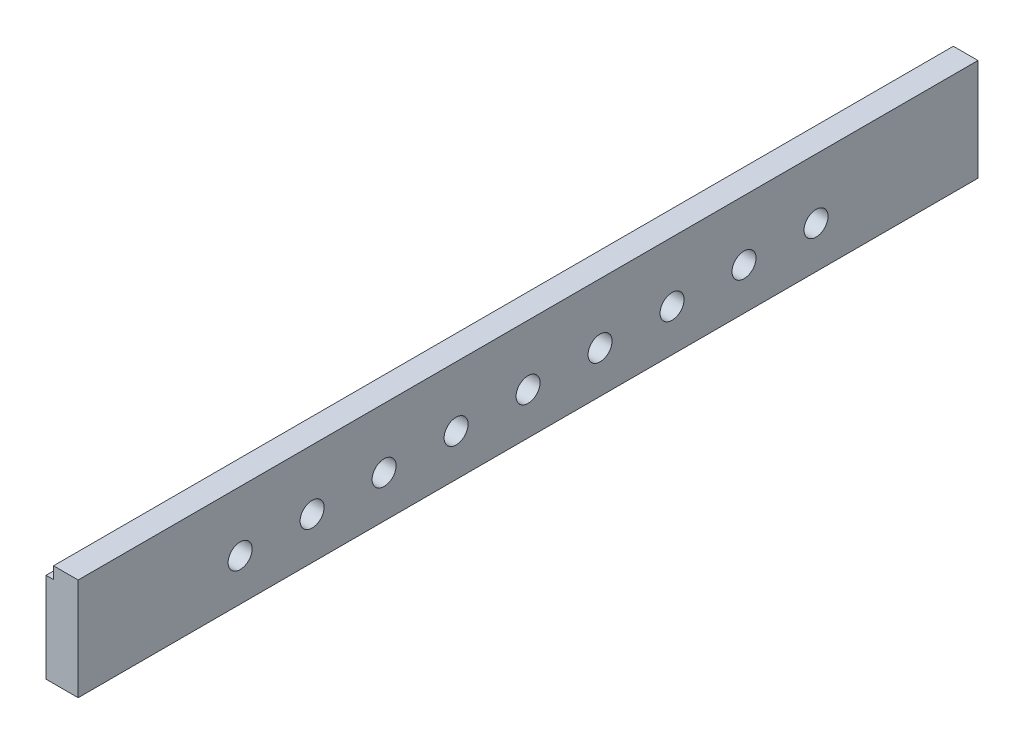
from build123d import *

# Parameters (mm, degrees)
VYSUNOUT1_DEPTH          = 150
SKICA2_R                 = 2
ODEBRAT_VYSUNUT_M1_DEPTH = 152.055385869
LINPOLE1_COUNT           = 9
LINPOLE1_PITCH           = 12


with BuildPart() as part:
    # Skica1 → Vysunout1 (new body)
    with BuildSketch(Plane.XY):
        Polygon((0, 0), (0, 15), (1.25, 15), (1.25, 17), (5.36, 17), (5.36, 0), align=None)
    extrude(amount=-VYSUNOUT1_DEPTH)

    # Skica2 → Odebrat vysunut_m1 (cut, through all)
    with BuildSketch(Plane.ZY):
        with Locations((-123, 7)):
            Circle(SKICA2_R)
    odebrat_vysunut_m1 = extrude(amount=-ODEBRAT_VYSUNUT_M1_DEPTH, mode=Mode.SUBTRACT)

    # LinPole1: Odebrat vysunut_m1 ×9
    with Locations(*[(0, 0, i * LINPOLE1_PITCH) for i in range(1, LINPOLE1_COUNT)]):
        add(odebrat_vysunut_m1, mode=Mode.SUBTRACT)


solid = part.part
